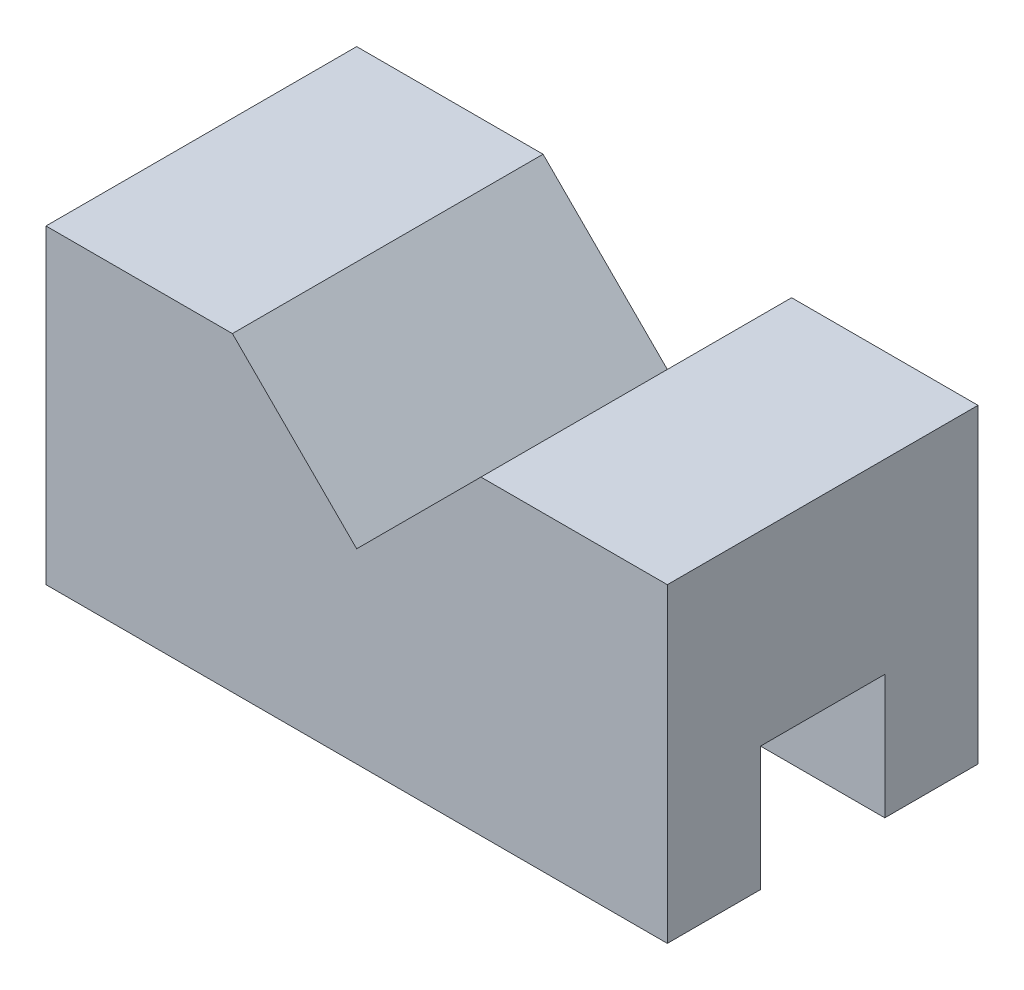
from build123d import *

# Parameters (mm, degrees)
EXTRUDE_1_DEPTH     = 25
SKETCH_2_W          = 20
SKETCH_2_H          = 20
CUT_EXTRUDE_1_DEPTH = 115.564392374


with BuildPart() as part:
    # Sketch 1 → Extrude 1 (new, symmetric)
    with BuildSketch(Plane.XY):
        Polygon((-20, 50), (0, 30), (20, 50), (50, 50), (50, 0), (-50, 0), (-50, 50), align=None)
    extrude(amount=EXTRUDE_1_DEPTH, both=True)

    # Sketch 2 → Cut-Extrude 1 (cut, through all)
    with BuildSketch(Plane(origin=(50, 0, 0), x_dir=(0, 0, -1), z_dir=(1, 0, 0))):
        with Locations((0, 10)):
            Rectangle(SKETCH_2_W, SKETCH_2_H)
    extrude(amount=-CUT_EXTRUDE_1_DEPTH, mode=Mode.SUBTRACT)


solid = part.part
